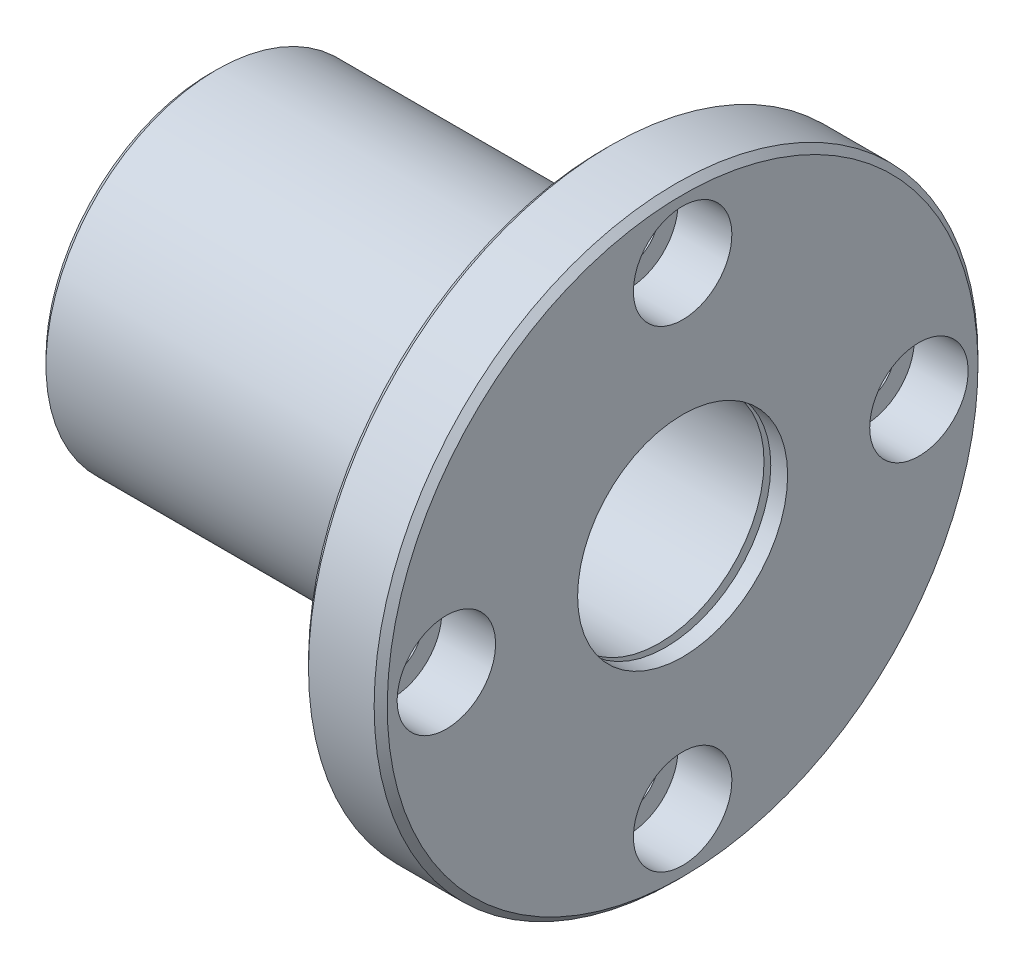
ISO-10303-21;
HEADER;
FILE_DESCRIPTION(('STEP AP214'),'2;1');
FILE_NAME('part.step','',(''),(''),'','','');
FILE_SCHEMA(('AUTOMOTIVE_DESIGN { 1 0 10303 214 1 1 1 1 }'));
ENDSEC;
DATA;
#1=APPLICATION_CONTEXT('core data for automotive mechanical design processes');
#2=APPLICATION_PROTOCOL_DEFINITION('international standard','automotive_design',2000,#1);
#3=PRODUCT_CONTEXT('',#1,'mechanical');
#4=PRODUCT('Part','Part','',(#3));
#5=PRODUCT_RELATED_PRODUCT_CATEGORY('part','',(#4));
#6=PRODUCT_DEFINITION_FORMATION('','',#4);
#7=PRODUCT_DEFINITION_CONTEXT('part definition',#1,'design');
#8=PRODUCT_DEFINITION('design','',#6,#7);
#9=PRODUCT_DEFINITION_SHAPE('','',#8);
#10=(LENGTH_UNIT() NAMED_UNIT(*) SI_UNIT(.MILLI.,.METRE.));
#11=(NAMED_UNIT(*) PLANE_ANGLE_UNIT() SI_UNIT($,.RADIAN.));
#12=(NAMED_UNIT(*) SI_UNIT($,.STERADIAN.) SOLID_ANGLE_UNIT());
#13=UNCERTAINTY_MEASURE_WITH_UNIT(LENGTH_MEASURE(1.E-05),#10,'distance_accuracy_value','');
#14=(GEOMETRIC_REPRESENTATION_CONTEXT(3) GLOBAL_UNCERTAINTY_ASSIGNED_CONTEXT((#13)) GLOBAL_UNIT_ASSIGNED_CONTEXT((#10,
#11,#12)) REPRESENTATION_CONTEXT('',''));
#15=CARTESIAN_POINT('',(0.,0.,0.));
#16=DIRECTION('',(0.,0.,1.));
#17=DIRECTION('',(1.,0.,0.));
#18=AXIS2_PLACEMENT_3D('',#15,#16,#17);
#19=CARTESIAN_POINT('',(0.,10.5,0.));
#20=DIRECTION('',(-1.,0.,0.));
#21=DIRECTION('',(0.,0.,1.));
#22=AXIS2_PLACEMENT_3D('',#19,#20,#21);
#23=PLANE('',#22);
#24=CARTESIAN_POINT('',(0.,0.,0.));
#25=DIRECTION('',(-1.,0.,0.));
#26=DIRECTION('',(0.,1.,0.));
#27=AXIS2_PLACEMENT_3D('',#24,#25,#26);
#28=CIRCLE('',#27,8.5);
#29=CARTESIAN_POINT('',(0.,-8.5,0.));
#30=VERTEX_POINT('',#29);
#31=EDGE_CURVE('E273',#30,#30,#28,.T.);
#32=ORIENTED_EDGE('',*,*,#31,.F.);
#33=EDGE_LOOP('',(#32));
#34=FACE_BOUND('',#33,.T.);
#35=CARTESIAN_POINT('',(0.,0.,0.));
#36=DIRECTION('',(-1.,0.,0.));
#37=DIRECTION('',(0.,1.,0.));
#38=AXIS2_PLACEMENT_3D('',#35,#36,#37);
#39=CIRCLE('',#38,12.5);
#40=CARTESIAN_POINT('',(0.,-12.5,0.));
#41=VERTEX_POINT('',#40);
#42=EDGE_CURVE('E248',#41,#41,#39,.T.);
#43=ORIENTED_EDGE('',*,*,#42,.T.);
#44=EDGE_LOOP('',(#43));
#45=FACE_BOUND('',#44,.T.);
#46=ADVANCED_FACE('F16',(#34,#45),#23,.T.);
#47=CARTESIAN_POINT('',(30.,17.9190437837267,0.));
#48=DIRECTION('',(-1.,0.,0.));
#49=DIRECTION('',(0.,0.,1.));
#50=AXIS2_PLACEMENT_3D('',#47,#48,#49);
#51=PLANE('',#50);
#52=CARTESIAN_POINT('',(30.,0.,0.));
#53=DIRECTION('',(-1.,0.,0.));
#54=DIRECTION('',(0.,1.,0.));
#55=AXIS2_PLACEMENT_3D('',#52,#53,#54);
#56=CIRCLE('',#55,13.3380875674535);
#57=CARTESIAN_POINT('',(30.,13.3380875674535,0.));
#58=VERTEX_POINT('',#57);
#59=CARTESIAN_POINT('',(30.,0.,-13.3380875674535));
#60=VERTEX_POINT('',#59);
#61=EDGE_CURVE('E222',#58,#60,#56,.T.);
#62=ORIENTED_EDGE('',*,*,#61,.F.);
#63=CARTESIAN_POINT('',(30.,0.,0.));
#64=DIRECTION('',(-1.,0.,0.));
#65=DIRECTION('',(0.,1.,0.));
#66=AXIS2_PLACEMENT_3D('',#63,#64,#65);
#67=CIRCLE('',#66,13.3380875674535);
#68=EDGE_CURVE('E218',#60,#58,#67,.T.);
#69=ORIENTED_EDGE('',*,*,#68,.F.);
#70=EDGE_LOOP('',(#62,#69));
#71=FACE_BOUND('',#70,.T.);
#72=CARTESIAN_POINT('',(30.,18.,0.));
#73=DIRECTION('',(1.,0.,0.));
#74=DIRECTION('',(0.,1.,0.));
#75=AXIS2_PLACEMENT_3D('',#72,#73,#74);
#76=CIRCLE('',#75,2.25);
#77=CARTESIAN_POINT('',(30.,15.75,0.));
#78=VERTEX_POINT('',#77);
#79=EDGE_CURVE('E297',#78,#78,#76,.T.);
#80=ORIENTED_EDGE('',*,*,#79,.T.);
#81=EDGE_LOOP('',(#80));
#82=FACE_BOUND('',#81,.T.);
#83=CARTESIAN_POINT('',(30.,-18.,0.));
#84=DIRECTION('',(1.,0.,0.));
#85=DIRECTION('',(0.,1.,0.));
#86=AXIS2_PLACEMENT_3D('',#83,#84,#85);
#87=CIRCLE('',#86,2.25);
#88=CARTESIAN_POINT('',(30.,-20.25,0.));
#89=VERTEX_POINT('',#88);
#90=EDGE_CURVE('E246',#89,#89,#87,.T.);
#91=ORIENTED_EDGE('',*,*,#90,.T.);
#92=EDGE_LOOP('',(#91));
#93=FACE_BOUND('',#92,.T.);
#94=CARTESIAN_POINT('',(30.,0.,18.));
#95=DIRECTION('',(1.,0.,0.));
#96=DIRECTION('',(0.,0.,-1.));
#97=AXIS2_PLACEMENT_3D('',#94,#95,#96);
#98=CIRCLE('',#97,2.25);
#99=CARTESIAN_POINT('',(30.,0.,20.25));
#100=VERTEX_POINT('',#99);
#101=EDGE_CURVE('E237',#100,#100,#98,.T.);
#102=ORIENTED_EDGE('',*,*,#101,.T.);
#103=EDGE_LOOP('',(#102));
#104=FACE_BOUND('',#103,.T.);
#105=CARTESIAN_POINT('',(30.,0.,-18.));
#106=DIRECTION('',(1.,0.,0.));
#107=DIRECTION('',(0.,0.,-1.));
#108=AXIS2_PLACEMENT_3D('',#105,#106,#107);
#109=CIRCLE('',#108,2.25);
#110=CARTESIAN_POINT('',(30.,0.,-15.75));
#111=VERTEX_POINT('',#110);
#112=EDGE_CURVE('E308',#111,#111,#109,.T.);
#113=ORIENTED_EDGE('',*,*,#112,.T.);
#114=EDGE_LOOP('',(#113));
#115=FACE_BOUND('',#114,.T.);
#116=CARTESIAN_POINT('',(30.,0.,0.));
#117=DIRECTION('',(-1.,0.,0.));
#118=DIRECTION('',(0.,1.,0.));
#119=AXIS2_PLACEMENT_3D('',#116,#117,#118);
#120=CIRCLE('',#119,22.5);
#121=CARTESIAN_POINT('',(30.,-22.5,0.));
#122=VERTEX_POINT('',#121);
#123=EDGE_CURVE('E262',#122,#122,#120,.T.);
#124=ORIENTED_EDGE('',*,*,#123,.T.);
#125=EDGE_LOOP('',(#124));
#126=FACE_BOUND('',#125,.T.);
#127=ADVANCED_FACE('F405',(#71,#82,#93,#104,#115,#126),#51,.T.);
#128=CARTESIAN_POINT('',(36.,15.25,0.));
#129=DIRECTION('',(1.,0.,0.));
#130=DIRECTION('',(0.,1.,0.));
#131=AXIS2_PLACEMENT_3D('',#128,#129,#130);
#132=PLANE('',#131);
#133=CARTESIAN_POINT('',(36.,18.,0.));
#134=DIRECTION('',(-1.,0.,0.));
#135=DIRECTION('',(0.,1.,0.));
#136=AXIS2_PLACEMENT_3D('',#133,#134,#135);
#137=CIRCLE('',#136,3.75);
#138=CARTESIAN_POINT('',(36.,14.25,0.));
#139=VERTEX_POINT('',#138);
#140=EDGE_CURVE('E243',#139,#139,#137,.T.);
#141=ORIENTED_EDGE('',*,*,#140,.T.);
#142=EDGE_LOOP('',(#141));
#143=FACE_BOUND('',#142,.T.);
#144=CARTESIAN_POINT('',(36.,-18.,0.));
#145=DIRECTION('',(-1.,0.,0.));
#146=DIRECTION('',(0.,1.,0.));
#147=AXIS2_PLACEMENT_3D('',#144,#145,#146);
#148=CIRCLE('',#147,3.75);
#149=CARTESIAN_POINT('',(36.,-21.75,0.));
#150=VERTEX_POINT('',#149);
#151=EDGE_CURVE('E242',#150,#150,#148,.T.);
#152=ORIENTED_EDGE('',*,*,#151,.T.);
#153=EDGE_LOOP('',(#152));
#154=FACE_BOUND('',#153,.T.);
#155=CARTESIAN_POINT('',(36.,0.,18.));
#156=DIRECTION('',(-1.,0.,0.));
#157=DIRECTION('',(0.,0.,-1.));
#158=AXIS2_PLACEMENT_3D('',#155,#156,#157);
#159=CIRCLE('',#158,3.75);
#160=CARTESIAN_POINT('',(36.,0.,21.75));
#161=VERTEX_POINT('',#160);
#162=EDGE_CURVE('E312',#161,#161,#159,.T.);
#163=ORIENTED_EDGE('',*,*,#162,.T.);
#164=EDGE_LOOP('',(#163));
#165=FACE_BOUND('',#164,.T.);
#166=CARTESIAN_POINT('',(36.,0.,-18.));
#167=DIRECTION('',(-1.,0.,0.));
#168=DIRECTION('',(0.,0.,-1.));
#169=AXIS2_PLACEMENT_3D('',#166,#167,#168);
#170=CIRCLE('',#169,3.75);
#171=CARTESIAN_POINT('',(36.,0.,-14.25));
#172=VERTEX_POINT('',#171);
#173=EDGE_CURVE('E10',#172,#172,#170,.T.);
#174=ORIENTED_EDGE('',*,*,#173,.T.);
#175=EDGE_LOOP('',(#174));
#176=FACE_BOUND('',#175,.T.);
#177=CARTESIAN_POINT('',(36.,0.,0.));
#178=DIRECTION('',(-1.,0.,0.));
#179=DIRECTION('',(0.,1.,0.));
#180=AXIS2_PLACEMENT_3D('',#177,#178,#179);
#181=CIRCLE('',#180,8.);
#182=CARTESIAN_POINT('',(36.,-8.,0.));
#183=VERTEX_POINT('',#182);
#184=EDGE_CURVE('E305',#183,#183,#181,.T.);
#185=ORIENTED_EDGE('',*,*,#184,.T.);
#186=EDGE_LOOP('',(#185));
#187=FACE_BOUND('',#186,.T.);
#188=CARTESIAN_POINT('',(36.,0.,0.));
#189=DIRECTION('',(-1.,0.,0.));
#190=DIRECTION('',(0.,1.,0.));
#191=AXIS2_PLACEMENT_3D('',#188,#189,#190);
#192=CIRCLE('',#191,22.5);
#193=CARTESIAN_POINT('',(36.,-22.5,0.));
#194=VERTEX_POINT('',#193);
#195=EDGE_CURVE('E282',#194,#194,#192,.T.);
#196=ORIENTED_EDGE('',*,*,#195,.F.);
#197=EDGE_LOOP('',(#196));
#198=FACE_BOUND('',#197,.T.);
#199=ADVANCED_FACE('F410',(#143,#154,#165,#176,#187,#198),#132,.T.);
#200=CARTESIAN_POINT('',(34.7142857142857,8.65,0.));
#201=DIRECTION('',(-1.,0.,0.));
#202=DIRECTION('',(0.,0.,1.));
#203=AXIS2_PLACEMENT_3D('',#200,#201,#202);
#204=PLANE('',#203);
#205=CARTESIAN_POINT('',(34.7142857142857,0.,0.));
#206=DIRECTION('',(-1.,0.,0.));
#207=DIRECTION('',(0.,1.,0.));
#208=AXIS2_PLACEMENT_3D('',#205,#206,#207);
#209=CIRCLE('',#208,8.);
#210=CARTESIAN_POINT('',(34.7142857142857,-8.,0.));
#211=VERTEX_POINT('',#210);
#212=EDGE_CURVE('E288',#211,#211,#209,.T.);
#213=ORIENTED_EDGE('',*,*,#212,.F.);
#214=EDGE_LOOP('',(#213));
#215=FACE_BOUND('',#214,.T.);
#216=CARTESIAN_POINT('',(34.7142857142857,0.,0.));
#217=DIRECTION('',(-1.,0.,0.));
#218=DIRECTION('',(0.,1.,0.));
#219=AXIS2_PLACEMENT_3D('',#216,#217,#218);
#220=CIRCLE('',#219,9.3);
#221=CARTESIAN_POINT('',(34.7142857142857,-9.3,0.));
#222=VERTEX_POINT('',#221);
#223=EDGE_CURVE('E216',#222,#222,#220,.T.);
#224=ORIENTED_EDGE('',*,*,#223,.T.);
#225=EDGE_LOOP('',(#224));
#226=FACE_BOUND('',#225,.T.);
#227=ADVANCED_FACE('F448',(#215,#226),#204,.T.);
#228=CARTESIAN_POINT('',(34.2,8.65,0.));
#229=DIRECTION('',(1.,0.,0.));
#230=DIRECTION('',(0.,1.,0.));
#231=AXIS2_PLACEMENT_3D('',#228,#229,#230);
#232=PLANE('',#231);
#233=CARTESIAN_POINT('',(34.2,0.,0.));
#234=DIRECTION('',(-1.,0.,0.));
#235=DIRECTION('',(0.,1.,0.));
#236=AXIS2_PLACEMENT_3D('',#233,#234,#235);
#237=CIRCLE('',#236,8.);
#238=CARTESIAN_POINT('',(34.2,-8.,0.));
#239=VERTEX_POINT('',#238);
#240=EDGE_CURVE('E319',#239,#239,#237,.T.);
#241=ORIENTED_EDGE('',*,*,#240,.T.);
#242=EDGE_LOOP('',(#241));
#243=FACE_BOUND('',#242,.T.);
#244=CARTESIAN_POINT('',(34.2,0.,0.));
#245=DIRECTION('',(-1.,0.,0.));
#246=DIRECTION('',(0.,1.,0.));
#247=AXIS2_PLACEMENT_3D('',#244,#245,#246);
#248=CIRCLE('',#247,9.3);
#249=CARTESIAN_POINT('',(34.2,-9.3,0.));
#250=VERTEX_POINT('',#249);
#251=EDGE_CURVE('E217',#250,#250,#248,.T.);
#252=ORIENTED_EDGE('',*,*,#251,.F.);
#253=EDGE_LOOP('',(#252));
#254=FACE_BOUND('',#253,.T.);
#255=ADVANCED_FACE('F454',(#243,#254),#232,.T.);
#256=CARTESIAN_POINT('',(1.8,8.65,0.));
#257=DIRECTION('',(-1.,0.,0.));
#258=DIRECTION('',(0.,0.,1.));
#259=AXIS2_PLACEMENT_3D('',#256,#257,#258);
#260=PLANE('',#259);
#261=CARTESIAN_POINT('',(1.8,0.,0.));
#262=DIRECTION('',(-1.,0.,0.));
#263=DIRECTION('',(0.,1.,0.));
#264=AXIS2_PLACEMENT_3D('',#261,#262,#263);
#265=CIRCLE('',#264,8.);
#266=CARTESIAN_POINT('',(1.8,-8.,0.));
#267=VERTEX_POINT('',#266);
#268=EDGE_CURVE('E318',#267,#267,#265,.T.);
#269=ORIENTED_EDGE('',*,*,#268,.F.);
#270=EDGE_LOOP('',(#269));
#271=FACE_BOUND('',#270,.T.);
#272=CARTESIAN_POINT('',(1.8,0.,0.));
#273=DIRECTION('',(-1.,0.,0.));
#274=DIRECTION('',(0.,1.,0.));
#275=AXIS2_PLACEMENT_3D('',#272,#273,#274);
#276=CIRCLE('',#275,9.3);
#277=CARTESIAN_POINT('',(1.8,-9.3,0.));
#278=VERTEX_POINT('',#277);
#279=EDGE_CURVE('E278',#278,#278,#276,.T.);
#280=ORIENTED_EDGE('',*,*,#279,.T.);
#281=EDGE_LOOP('',(#280));
#282=FACE_BOUND('',#281,.T.);
#283=ADVANCED_FACE('F458',(#271,#282),#260,.T.);
#284=CARTESIAN_POINT('',(1.28571428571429,8.9,0.));
#285=DIRECTION('',(1.,0.,0.));
#286=DIRECTION('',(0.,1.,0.));
#287=AXIS2_PLACEMENT_3D('',#284,#285,#286);
#288=PLANE('',#287);
#289=CARTESIAN_POINT('',(1.28571428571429,0.,0.));
#290=DIRECTION('',(-1.,0.,0.));
#291=DIRECTION('',(0.,1.,0.));
#292=AXIS2_PLACEMENT_3D('',#289,#290,#291);
#293=CIRCLE('',#292,8.5);
#294=CARTESIAN_POINT('',(1.28571428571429,-8.5,0.));
#295=VERTEX_POINT('',#294);
#296=EDGE_CURVE('E342',#295,#295,#293,.T.);
#297=ORIENTED_EDGE('',*,*,#296,.T.);
#298=EDGE_LOOP('',(#297));
#299=FACE_BOUND('',#298,.T.);
#300=CARTESIAN_POINT('',(1.28571428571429,0.,0.));
#301=DIRECTION('',(-1.,0.,0.));
#302=DIRECTION('',(0.,1.,0.));
#303=AXIS2_PLACEMENT_3D('',#300,#301,#302);
#304=CIRCLE('',#303,9.3);
#305=CARTESIAN_POINT('',(1.28571428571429,-9.3,0.));
#306=VERTEX_POINT('',#305);
#307=EDGE_CURVE('E322',#306,#306,#304,.T.);
#308=ORIENTED_EDGE('',*,*,#307,.F.);
#309=EDGE_LOOP('',(#308));
#310=FACE_BOUND('',#309,.T.);
#311=ADVANCED_FACE('F461',(#299,#310),#288,.T.);
#312=CARTESIAN_POINT('',(31.9,21.,0.));
#313=DIRECTION('',(-1.,0.,0.));
#314=DIRECTION('',(0.,0.,1.));
#315=AXIS2_PLACEMENT_3D('',#312,#313,#314);
#316=PLANE('',#315);
#317=CARTESIAN_POINT('',(31.9,18.,0.));
#318=DIRECTION('',(-1.,0.,0.));
#319=DIRECTION('',(0.,1.,0.));
#320=AXIS2_PLACEMENT_3D('',#317,#318,#319);
#321=CIRCLE('',#320,2.25);
#322=CARTESIAN_POINT('',(31.9,15.75,0.));
#323=VERTEX_POINT('',#322);
#324=EDGE_CURVE('E296',#323,#323,#321,.T.);
#325=ORIENTED_EDGE('',*,*,#324,.T.);
#326=EDGE_LOOP('',(#325));
#327=FACE_BOUND('',#326,.T.);
#328=CARTESIAN_POINT('',(31.9,18.,0.));
#329=DIRECTION('',(-1.,0.,0.));
#330=DIRECTION('',(0.,1.,0.));
#331=AXIS2_PLACEMENT_3D('',#328,#329,#330);
#332=CIRCLE('',#331,3.75);
#333=CARTESIAN_POINT('',(31.9,14.25,0.));
#334=VERTEX_POINT('',#333);
#335=EDGE_CURVE('E348',#334,#334,#332,.T.);
#336=ORIENTED_EDGE('',*,*,#335,.F.);
#337=EDGE_LOOP('',(#336));
#338=FACE_BOUND('',#337,.T.);
#339=ADVANCED_FACE('F463',(#327,#338),#316,.F.);
#340=CARTESIAN_POINT('',(31.9,-15.,0.));
#341=DIRECTION('',(-1.,0.,0.));
#342=DIRECTION('',(0.,0.,1.));
#343=AXIS2_PLACEMENT_3D('',#340,#341,#342);
#344=PLANE('',#343);
#345=CARTESIAN_POINT('',(31.9,-18.,0.));
#346=DIRECTION('',(-1.,0.,0.));
#347=DIRECTION('',(0.,1.,0.));
#348=AXIS2_PLACEMENT_3D('',#345,#346,#347);
#349=CIRCLE('',#348,2.25);
#350=CARTESIAN_POINT('',(31.9,-20.25,0.));
#351=VERTEX_POINT('',#350);
#352=EDGE_CURVE('E364',#351,#351,#349,.T.);
#353=ORIENTED_EDGE('',*,*,#352,.T.);
#354=EDGE_LOOP('',(#353));
#355=FACE_BOUND('',#354,.T.);
#356=CARTESIAN_POINT('',(31.9,-18.,0.));
#357=DIRECTION('',(-1.,0.,0.));
#358=DIRECTION('',(0.,1.,0.));
#359=AXIS2_PLACEMENT_3D('',#356,#357,#358);
#360=CIRCLE('',#359,3.75);
#361=CARTESIAN_POINT('',(31.9,-21.75,0.));
#362=VERTEX_POINT('',#361);
#363=EDGE_CURVE('E367',#362,#362,#360,.T.);
#364=ORIENTED_EDGE('',*,*,#363,.F.);
#365=EDGE_LOOP('',(#364));
#366=FACE_BOUND('',#365,.T.);
#367=ADVANCED_FACE('F400',(#355,#366),#344,.F.);
#368=CARTESIAN_POINT('',(31.9,0.,15.));
#369=DIRECTION('',(-1.,0.,0.));
#370=DIRECTION('',(0.,0.,1.));
#371=AXIS2_PLACEMENT_3D('',#368,#369,#370);
#372=PLANE('',#371);
#373=CARTESIAN_POINT('',(31.9,0.,18.));
#374=DIRECTION('',(-1.,0.,0.));
#375=DIRECTION('',(0.,0.,-1.));
#376=AXIS2_PLACEMENT_3D('',#373,#374,#375);
#377=CIRCLE('',#376,2.25);
#378=CARTESIAN_POINT('',(31.9,0.,20.25));
#379=VERTEX_POINT('',#378);
#380=EDGE_CURVE('E283',#379,#379,#377,.T.);
#381=ORIENTED_EDGE('',*,*,#380,.T.);
#382=EDGE_LOOP('',(#381));
#383=FACE_BOUND('',#382,.T.);
#384=CARTESIAN_POINT('',(31.9,0.,18.));
#385=DIRECTION('',(-1.,0.,0.));
#386=DIRECTION('',(0.,0.,-1.));
#387=AXIS2_PLACEMENT_3D('',#384,#385,#386);
#388=CIRCLE('',#387,3.75);
#389=CARTESIAN_POINT('',(31.9,0.,21.75));
#390=VERTEX_POINT('',#389);
#391=EDGE_CURVE('E210',#390,#390,#388,.T.);
#392=ORIENTED_EDGE('',*,*,#391,.F.);
#393=EDGE_LOOP('',(#392));
#394=FACE_BOUND('',#393,.T.);
#395=ADVANCED_FACE('F390',(#383,#394),#372,.F.);
#396=CARTESIAN_POINT('',(31.9,0.,-21.));
#397=DIRECTION('',(-1.,0.,0.));
#398=DIRECTION('',(0.,0.,1.));
#399=AXIS2_PLACEMENT_3D('',#396,#397,#398);
#400=PLANE('',#399);
#401=CARTESIAN_POINT('',(31.9,0.,-18.));
#402=DIRECTION('',(-1.,0.,0.));
#403=DIRECTION('',(0.,0.,-1.));
#404=AXIS2_PLACEMENT_3D('',#401,#402,#403);
#405=CIRCLE('',#404,2.25);
#406=CARTESIAN_POINT('',(31.9,0.,-15.75));
#407=VERTEX_POINT('',#406);
#408=EDGE_CURVE('E253',#407,#407,#405,.T.);
#409=ORIENTED_EDGE('',*,*,#408,.T.);
#410=EDGE_LOOP('',(#409));
#411=FACE_BOUND('',#410,.T.);
#412=CARTESIAN_POINT('',(31.9,0.,-18.));
#413=DIRECTION('',(-1.,0.,0.));
#414=DIRECTION('',(0.,0.,-1.));
#415=AXIS2_PLACEMENT_3D('',#412,#413,#414);
#416=CIRCLE('',#415,3.75);
#417=CARTESIAN_POINT('',(31.9,0.,-14.25));
#418=VERTEX_POINT('',#417);
#419=EDGE_CURVE('E256',#418,#418,#416,.T.);
#420=ORIENTED_EDGE('',*,*,#419,.F.);
#421=EDGE_LOOP('',(#420));
#422=FACE_BOUND('',#421,.T.);
#423=ADVANCED_FACE('F388',(#411,#422),#400,.F.);
#424=CARTESIAN_POINT('',(33.95,0.,-18.));
#425=DIRECTION('',(1.,0.,0.));
#426=DIRECTION('',(0.,0.,-1.));
#427=AXIS2_PLACEMENT_3D('',#424,#425,#426);
#428=CYLINDRICAL_SURFACE('',#427,3.75);
#429=ORIENTED_EDGE('',*,*,#419,.T.);
#430=DIRECTION('',(1.,0.,0.));
#431=VECTOR('',#430,1.);
#432=CARTESIAN_POINT('',(33.95,0.,-14.25));
#433=LINE('',#432,#431);
#434=EDGE_CURVE('E24',#418,#172,#433,.T.);
#435=ORIENTED_EDGE('',*,*,#434,.T.);
#436=ORIENTED_EDGE('',*,*,#173,.F.);
#437=ORIENTED_EDGE('',*,*,#434,.F.);
#438=EDGE_LOOP('',(#429,#435,#436,#437));
#439=FACE_BOUND('',#438,.T.);
#440=ADVANCED_FACE('F386',(#439),#428,.F.);
#441=CARTESIAN_POINT('',(30.95,0.,-18.));
#442=DIRECTION('',(1.,0.,0.));
#443=DIRECTION('',(0.,0.,-1.));
#444=AXIS2_PLACEMENT_3D('',#441,#442,#443);
#445=CYLINDRICAL_SURFACE('',#444,2.25);
#446=ORIENTED_EDGE('',*,*,#112,.F.);
#447=DIRECTION('',(1.,0.,0.));
#448=VECTOR('',#447,1.);
#449=CARTESIAN_POINT('',(30.95,0.,-15.75));
#450=LINE('',#449,#448);
#451=EDGE_CURVE('E257',#111,#407,#450,.T.);
#452=ORIENTED_EDGE('',*,*,#451,.T.);
#453=ORIENTED_EDGE('',*,*,#408,.F.);
#454=ORIENTED_EDGE('',*,*,#451,.F.);
#455=EDGE_LOOP('',(#446,#452,#453,#454));
#456=FACE_BOUND('',#455,.T.);
#457=ADVANCED_FACE('F398',(#456),#445,.F.);
#458=CARTESIAN_POINT('',(33.95,0.,18.));
#459=DIRECTION('',(1.,0.,0.));
#460=DIRECTION('',(0.,0.,-1.));
#461=AXIS2_PLACEMENT_3D('',#458,#459,#460);
#462=CYLINDRICAL_SURFACE('',#461,3.75);
#463=ORIENTED_EDGE('',*,*,#391,.T.);
#464=DIRECTION('',(1.,0.,0.));
#465=VECTOR('',#464,1.);
#466=CARTESIAN_POINT('',(33.95,0.,21.75));
#467=LINE('',#466,#465);
#468=EDGE_CURVE('E377',#390,#161,#467,.T.);
#469=ORIENTED_EDGE('',*,*,#468,.T.);
#470=ORIENTED_EDGE('',*,*,#162,.F.);
#471=ORIENTED_EDGE('',*,*,#468,.F.);
#472=EDGE_LOOP('',(#463,#469,#470,#471));
#473=FACE_BOUND('',#472,.T.);
#474=ADVANCED_FACE('F525',(#473),#462,.F.);
#475=CARTESIAN_POINT('',(30.95,0.,18.));
#476=DIRECTION('',(1.,0.,0.));
#477=DIRECTION('',(0.,0.,-1.));
#478=AXIS2_PLACEMENT_3D('',#475,#476,#477);
#479=CYLINDRICAL_SURFACE('',#478,2.25);
#480=ORIENTED_EDGE('',*,*,#101,.F.);
#481=DIRECTION('',(1.,0.,0.));
#482=VECTOR('',#481,1.);
#483=CARTESIAN_POINT('',(30.95,0.,20.25));
#484=LINE('',#483,#482);
#485=EDGE_CURVE('E241',#100,#379,#484,.T.);
#486=ORIENTED_EDGE('',*,*,#485,.T.);
#487=ORIENTED_EDGE('',*,*,#380,.F.);
#488=ORIENTED_EDGE('',*,*,#485,.F.);
#489=EDGE_LOOP('',(#480,#486,#487,#488));
#490=FACE_BOUND('',#489,.T.);
#491=ADVANCED_FACE('F522',(#490),#479,.F.);
#492=CARTESIAN_POINT('',(33.95,-18.,0.));
#493=DIRECTION('',(1.,0.,0.));
#494=DIRECTION('',(0.,1.,0.));
#495=AXIS2_PLACEMENT_3D('',#492,#493,#494);
#496=CYLINDRICAL_SURFACE('',#495,3.75);
#497=ORIENTED_EDGE('',*,*,#363,.T.);
#498=DIRECTION('',(1.,0.,0.));
#499=VECTOR('',#498,1.);
#500=CARTESIAN_POINT('',(33.95,-21.75,0.));
#501=LINE('',#500,#499);
#502=EDGE_CURVE('E291',#362,#150,#501,.T.);
#503=ORIENTED_EDGE('',*,*,#502,.T.);
#504=ORIENTED_EDGE('',*,*,#151,.F.);
#505=ORIENTED_EDGE('',*,*,#502,.F.);
#506=EDGE_LOOP('',(#497,#503,#504,#505));
#507=FACE_BOUND('',#506,.T.);
#508=ADVANCED_FACE('F475',(#507),#496,.F.);
#509=CARTESIAN_POINT('',(30.95,-18.,0.));
#510=DIRECTION('',(1.,0.,0.));
#511=DIRECTION('',(0.,1.,0.));
#512=AXIS2_PLACEMENT_3D('',#509,#510,#511);
#513=CYLINDRICAL_SURFACE('',#512,2.25);
#514=ORIENTED_EDGE('',*,*,#90,.F.);
#515=DIRECTION('',(1.,0.,0.));
#516=VECTOR('',#515,1.);
#517=CARTESIAN_POINT('',(30.95,-20.25,0.));
#518=LINE('',#517,#516);
#519=EDGE_CURVE('E360',#89,#351,#518,.T.);
#520=ORIENTED_EDGE('',*,*,#519,.T.);
#521=ORIENTED_EDGE('',*,*,#352,.F.);
#522=ORIENTED_EDGE('',*,*,#519,.F.);
#523=EDGE_LOOP('',(#514,#520,#521,#522));
#524=FACE_BOUND('',#523,.T.);
#525=ADVANCED_FACE('F511',(#524),#513,.F.);
#526=CARTESIAN_POINT('',(33.95,18.,0.));
#527=DIRECTION('',(1.,0.,0.));
#528=DIRECTION('',(0.,1.,0.));
#529=AXIS2_PLACEMENT_3D('',#526,#527,#528);
#530=CYLINDRICAL_SURFACE('',#529,3.75);
#531=ORIENTED_EDGE('',*,*,#335,.T.);
#532=DIRECTION('',(1.,0.,0.));
#533=VECTOR('',#532,1.);
#534=CARTESIAN_POINT('',(33.95,14.25,0.));
#535=LINE('',#534,#533);
#536=EDGE_CURVE('E247',#334,#139,#535,.T.);
#537=ORIENTED_EDGE('',*,*,#536,.T.);
#538=ORIENTED_EDGE('',*,*,#140,.F.);
#539=ORIENTED_EDGE('',*,*,#536,.F.);
#540=EDGE_LOOP('',(#531,#537,#538,#539));
#541=FACE_BOUND('',#540,.T.);
#542=ADVANCED_FACE('F507',(#541),#530,.F.);
#543=CARTESIAN_POINT('',(30.95,18.,0.));
#544=DIRECTION('',(1.,0.,0.));
#545=DIRECTION('',(0.,1.,0.));
#546=AXIS2_PLACEMENT_3D('',#543,#544,#545);
#547=CYLINDRICAL_SURFACE('',#546,2.25);
#548=ORIENTED_EDGE('',*,*,#79,.F.);
#549=DIRECTION('',(1.,0.,0.));
#550=VECTOR('',#549,1.);
#551=CARTESIAN_POINT('',(30.95,15.75,0.));
#552=LINE('',#551,#550);
#553=EDGE_CURVE('E292',#78,#323,#552,.T.);
#554=ORIENTED_EDGE('',*,*,#553,.T.);
#555=ORIENTED_EDGE('',*,*,#324,.F.);
#556=ORIENTED_EDGE('',*,*,#553,.F.);
#557=EDGE_LOOP('',(#548,#554,#555,#556));
#558=FACE_BOUND('',#557,.T.);
#559=ADVANCED_FACE('F510',(#558),#547,.F.);
#560=CARTESIAN_POINT('',(0.642857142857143,0.,0.));
#561=DIRECTION('',(1.,0.,0.));
#562=DIRECTION('',(0.,1.,0.));
#563=AXIS2_PLACEMENT_3D('',#560,#561,#562);
#564=CYLINDRICAL_SURFACE('',#563,8.5);
#565=ORIENTED_EDGE('',*,*,#31,.T.);
#566=DIRECTION('',(1.,0.,0.));
#567=VECTOR('',#566,1.);
#568=CARTESIAN_POINT('',(0.642857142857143,-8.5,0.));
#569=LINE('',#568,#567);
#570=EDGE_CURVE('E277',#30,#295,#569,.T.);
#571=ORIENTED_EDGE('',*,*,#570,.T.);
#572=ORIENTED_EDGE('',*,*,#296,.F.);
#573=ORIENTED_EDGE('',*,*,#570,.F.);
#574=EDGE_LOOP('',(#565,#571,#572,#573));
#575=FACE_BOUND('',#574,.T.);
#576=ADVANCED_FACE('F515',(#575),#564,.F.);
#577=CARTESIAN_POINT('',(1.54285714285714,0.,0.));
#578=DIRECTION('',(1.,0.,0.));
#579=DIRECTION('',(0.,1.,0.));
#580=AXIS2_PLACEMENT_3D('',#577,#578,#579);
#581=CYLINDRICAL_SURFACE('',#580,9.3);
#582=ORIENTED_EDGE('',*,*,#307,.T.);
#583=DIRECTION('',(1.,0.,0.));
#584=VECTOR('',#583,1.);
#585=CARTESIAN_POINT('',(1.54285714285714,-9.3,0.));
#586=LINE('',#585,#584);
#587=EDGE_CURVE('E333',#306,#278,#586,.T.);
#588=ORIENTED_EDGE('',*,*,#587,.T.);
#589=ORIENTED_EDGE('',*,*,#279,.F.);
#590=ORIENTED_EDGE('',*,*,#587,.F.);
#591=EDGE_LOOP('',(#582,#588,#589,#590));
#592=FACE_BOUND('',#591,.T.);
#593=ADVANCED_FACE('F505',(#592),#581,.F.);
#594=CARTESIAN_POINT('',(18.,0.,0.));
#595=DIRECTION('',(1.,0.,0.));
#596=DIRECTION('',(0.,1.,0.));
#597=AXIS2_PLACEMENT_3D('',#594,#595,#596);
#598=CYLINDRICAL_SURFACE('',#597,8.);
#599=ORIENTED_EDGE('',*,*,#268,.T.);
#600=DIRECTION('',(1.,0.,0.));
#601=VECTOR('',#600,1.);
#602=CARTESIAN_POINT('',(18.,-8.,0.));
#603=LINE('',#602,#601);
#604=EDGE_CURVE('E323',#267,#239,#603,.T.);
#605=ORIENTED_EDGE('',*,*,#604,.T.);
#606=ORIENTED_EDGE('',*,*,#240,.F.);
#607=ORIENTED_EDGE('',*,*,#604,.F.);
#608=EDGE_LOOP('',(#599,#605,#606,#607));
#609=FACE_BOUND('',#608,.T.);
#610=ADVANCED_FACE('F502',(#609),#598,.F.);
#611=CARTESIAN_POINT('',(34.4571428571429,0.,0.));
#612=DIRECTION('',(1.,0.,0.));
#613=DIRECTION('',(0.,1.,0.));
#614=AXIS2_PLACEMENT_3D('',#611,#612,#613);
#615=CYLINDRICAL_SURFACE('',#614,9.3);
#616=ORIENTED_EDGE('',*,*,#251,.T.);
#617=DIRECTION('',(1.,0.,0.));
#618=VECTOR('',#617,1.);
#619=CARTESIAN_POINT('',(34.4571428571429,-9.3,0.));
#620=LINE('',#619,#618);
#621=EDGE_CURVE('E212',#250,#222,#620,.T.);
#622=ORIENTED_EDGE('',*,*,#621,.T.);
#623=ORIENTED_EDGE('',*,*,#223,.F.);
#624=ORIENTED_EDGE('',*,*,#621,.F.);
#625=EDGE_LOOP('',(#616,#622,#623,#624));
#626=FACE_BOUND('',#625,.T.);
#627=ADVANCED_FACE('F487',(#626),#615,.F.);
#628=CARTESIAN_POINT('',(35.3571428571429,0.,0.));
#629=DIRECTION('',(1.,0.,0.));
#630=DIRECTION('',(0.,1.,0.));
#631=AXIS2_PLACEMENT_3D('',#628,#629,#630);
#632=CYLINDRICAL_SURFACE('',#631,8.);
#633=ORIENTED_EDGE('',*,*,#212,.T.);
#634=DIRECTION('',(1.,0.,0.));
#635=VECTOR('',#634,1.);
#636=CARTESIAN_POINT('',(35.3571428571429,-8.,0.));
#637=LINE('',#636,#635);
#638=EDGE_CURVE('E301',#211,#183,#637,.T.);
#639=ORIENTED_EDGE('',*,*,#638,.T.);
#640=ORIENTED_EDGE('',*,*,#184,.F.);
#641=ORIENTED_EDGE('',*,*,#638,.F.);
#642=EDGE_LOOP('',(#633,#639,#640,#641));
#643=FACE_BOUND('',#642,.T.);
#644=ADVANCED_FACE('F482',(#643),#632,.F.);
#645=CARTESIAN_POINT('',(35.75,0.,0.));
#646=DIRECTION('',(-1.,0.,0.));
#647=DIRECTION('',(0.,1.,0.));
#648=AXIS2_PLACEMENT_3D('',#645,#646,#647);
#649=CONICAL_SURFACE('',#648,22.75,0.785398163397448);
#650=CARTESIAN_POINT('',(35.5,0.,0.));
#651=DIRECTION('',(-1.,0.,0.));
#652=DIRECTION('',(0.,1.,0.));
#653=AXIS2_PLACEMENT_3D('',#650,#651,#652);
#654=CIRCLE('',#653,23.);
#655=CARTESIAN_POINT('',(35.5,-23.,0.));
#656=VERTEX_POINT('',#655);
#657=EDGE_CURVE('E236',#656,#656,#654,.T.);
#658=ORIENTED_EDGE('',*,*,#657,.F.);
#659=DIRECTION('',(0.707106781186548,0.707106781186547,0.));
#660=VECTOR('',#659,1.);
#661=CARTESIAN_POINT('',(35.75,-22.75,0.));
#662=LINE('',#661,#660);
#663=EDGE_CURVE('E235',#656,#194,#662,.T.);
#664=ORIENTED_EDGE('',*,*,#663,.T.);
#665=ORIENTED_EDGE('',*,*,#195,.T.);
#666=ORIENTED_EDGE('',*,*,#663,.F.);
#667=EDGE_LOOP('',(#658,#664,#665,#666));
#668=FACE_BOUND('',#667,.T.);
#669=ADVANCED_FACE('F444',(#668),#649,.T.);
#670=CARTESIAN_POINT('',(33.,0.,0.));
#671=DIRECTION('',(1.,0.,0.));
#672=DIRECTION('',(0.,1.,0.));
#673=AXIS2_PLACEMENT_3D('',#670,#671,#672);
#674=CYLINDRICAL_SURFACE('',#673,23.);
#675=ORIENTED_EDGE('',*,*,#657,.T.);
#676=DIRECTION('',(-1.,0.,0.));
#677=VECTOR('',#676,1.);
#678=CARTESIAN_POINT('',(33.,-23.,0.));
#679=LINE('',#678,#677);
#680=CARTESIAN_POINT('',(30.5,-23.,0.));
#681=VERTEX_POINT('',#680);
#682=EDGE_CURVE('E232',#656,#681,#679,.T.);
#683=ORIENTED_EDGE('',*,*,#682,.T.);
#684=CARTESIAN_POINT('',(30.5,0.,0.));
#685=DIRECTION('',(-1.,0.,0.));
#686=DIRECTION('',(0.,1.,0.));
#687=AXIS2_PLACEMENT_3D('',#684,#685,#686);
#688=CIRCLE('',#687,23.);
#689=EDGE_CURVE('E192',#681,#681,#688,.T.);
#690=ORIENTED_EDGE('',*,*,#689,.F.);
#691=ORIENTED_EDGE('',*,*,#682,.F.);
#692=EDGE_LOOP('',(#675,#683,#690,#691));
#693=FACE_BOUND('',#692,.T.);
#694=ADVANCED_FACE('F441',(#693),#674,.T.);
#695=CARTESIAN_POINT('',(30.25,0.,0.));
#696=DIRECTION('',(1.,0.,0.));
#697=DIRECTION('',(0.,1.,0.));
#698=AXIS2_PLACEMENT_3D('',#695,#696,#697);
#699=CONICAL_SURFACE('',#698,22.75,0.785398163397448);
#700=ORIENTED_EDGE('',*,*,#689,.T.);
#701=DIRECTION('',(-0.707106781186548,0.707106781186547,0.));
#702=VECTOR('',#701,1.);
#703=CARTESIAN_POINT('',(30.25,-22.75,0.));
#704=LINE('',#703,#702);
#705=EDGE_CURVE('E267',#681,#122,#704,.T.);
#706=ORIENTED_EDGE('',*,*,#705,.T.);
#707=ORIENTED_EDGE('',*,*,#123,.F.);
#708=ORIENTED_EDGE('',*,*,#705,.F.);
#709=EDGE_LOOP('',(#700,#706,#707,#708));
#710=FACE_BOUND('',#709,.T.);
#711=ADVANCED_FACE('F437',(#710),#699,.T.);
#712=CARTESIAN_POINT('',(28.7323445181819,0.,0.));
#713=DIRECTION('',(-1.,0.,0.));
#714=DIRECTION('',(0.,1.,0.));
#715=AXIS2_PLACEMENT_3D('',#712,#713,#714);
#716=CONICAL_SURFACE('',#715,12.8767721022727,0.227474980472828);
#717=CARTESIAN_POINT('',(28.2,0.,0.));
#718=DIRECTION('',(-1.,0.,0.));
#719=DIRECTION('',(0.,1.,0.));
#720=AXIS2_PLACEMENT_3D('',#717,#718,#719);
#721=CIRCLE('',#720,13.);
#722=CARTESIAN_POINT('',(28.2,-13.,0.));
#723=VERTEX_POINT('',#722);
#724=EDGE_CURVE('E189',#723,#723,#721,.T.);
#725=ORIENTED_EDGE('',*,*,#724,.F.);
#726=DIRECTION('',(0.974238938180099,0.225518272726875,0.));
#727=VECTOR('',#726,1.);
#728=CARTESIAN_POINT('',(28.7323445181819,-12.8767721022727,0.));
#729=LINE('',#728,#727);
#730=CARTESIAN_POINT('',(29.2646890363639,-12.7535442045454,0.));
#731=VERTEX_POINT('',#730);
#732=EDGE_CURVE('E183',#723,#731,#729,.T.);
#733=ORIENTED_EDGE('',*,*,#732,.T.);
#734=CARTESIAN_POINT('',(29.2646890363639,0.,0.));
#735=DIRECTION('',(-1.,0.,0.));
#736=DIRECTION('',(0.,1.,0.));
#737=AXIS2_PLACEMENT_3D('',#734,#735,#736);
#738=CIRCLE('',#737,12.7535442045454);
#739=CARTESIAN_POINT('',(29.2646890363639,0.,-12.7535442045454));
#740=VERTEX_POINT('',#739);
#741=EDGE_CURVE('E187',#731,#740,#738,.T.);
#742=ORIENTED_EDGE('',*,*,#741,.T.);
#743=CARTESIAN_POINT('',(29.2646890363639,0.,0.));
#744=DIRECTION('',(-1.,0.,0.));
#745=DIRECTION('',(0.,1.,0.));
#746=AXIS2_PLACEMENT_3D('',#743,#744,#745);
#747=CIRCLE('',#746,12.7535442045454);
#748=EDGE_CURVE('E196',#740,#731,#747,.T.);
#749=ORIENTED_EDGE('',*,*,#748,.T.);
#750=ORIENTED_EDGE('',*,*,#732,.F.);
#751=EDGE_LOOP('',(#725,#733,#742,#749,#750));
#752=FACE_BOUND('',#751,.T.);
#753=ADVANCED_FACE('F185',(#752),#716,.T.);
#754=CARTESIAN_POINT('',(14.35,0.,0.));
#755=DIRECTION('',(1.,0.,0.));
#756=DIRECTION('',(0.,1.,0.));
#757=AXIS2_PLACEMENT_3D('',#754,#755,#756);
#758=CYLINDRICAL_SURFACE('',#757,13.);
#759=ORIENTED_EDGE('',*,*,#724,.T.);
#760=DIRECTION('',(-1.,0.,0.));
#761=VECTOR('',#760,1.);
#762=CARTESIAN_POINT('',(14.35,-13.,0.));
#763=LINE('',#762,#761);
#764=CARTESIAN_POINT('',(0.5,-13.,0.));
#765=VERTEX_POINT('',#764);
#766=EDGE_CURVE('E193',#723,#765,#763,.T.);
#767=ORIENTED_EDGE('',*,*,#766,.T.);
#768=CARTESIAN_POINT('',(0.5,0.,0.));
#769=DIRECTION('',(-1.,0.,0.));
#770=DIRECTION('',(0.,1.,0.));
#771=AXIS2_PLACEMENT_3D('',#768,#769,#770);
#772=CIRCLE('',#771,13.);
#773=EDGE_CURVE('E227',#765,#765,#772,.T.);
#774=ORIENTED_EDGE('',*,*,#773,.F.);
#775=ORIENTED_EDGE('',*,*,#766,.F.);
#776=EDGE_LOOP('',(#759,#767,#774,#775));
#777=FACE_BOUND('',#776,.T.);
#778=ADVANCED_FACE('F610',(#777),#758,.T.);
#779=CARTESIAN_POINT('',(0.25,0.,0.));
#780=DIRECTION('',(1.,0.,0.));
#781=DIRECTION('',(0.,1.,0.));
#782=AXIS2_PLACEMENT_3D('',#779,#780,#781);
#783=CONICAL_SURFACE('',#782,12.75,0.785398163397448);
#784=ORIENTED_EDGE('',*,*,#773,.T.);
#785=DIRECTION('',(-0.707106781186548,0.707106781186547,0.));
#786=VECTOR('',#785,1.);
#787=CARTESIAN_POINT('',(0.25,-12.75,0.));
#788=LINE('',#787,#786);
#789=EDGE_CURVE('E231',#765,#41,#788,.T.);
#790=ORIENTED_EDGE('',*,*,#789,.T.);
#791=ORIENTED_EDGE('',*,*,#42,.F.);
#792=ORIENTED_EDGE('',*,*,#789,.F.);
#793=EDGE_LOOP('',(#784,#790,#791,#792));
#794=FACE_BOUND('',#793,.T.);
#795=ADVANCED_FACE('F418',(#794),#783,.T.);
#796=CARTESIAN_POINT('',(29.4,0.,0.));
#797=DIRECTION('',(-1.,0.,0.));
#798=DIRECTION('',(0.,0.,1.));
#799=AXIS2_PLACEMENT_3D('',#796,#797,#798);
#800=TOROIDAL_SURFACE('',#799,13.3380875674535,0.6);
#801=ORIENTED_EDGE('',*,*,#741,.F.);
#802=ORIENTED_EDGE('',*,*,#748,.F.);
#803=CARTESIAN_POINT('',(29.4,0.,-13.3380875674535));
#804=DIRECTION('',(0.,1.,0.));
#805=DIRECTION('',(0.,0.,-1.));
#806=AXIS2_PLACEMENT_3D('',#803,#804,#805);
#807=CIRCLE('',#806,0.6);
#808=EDGE_CURVE('E200',#740,#60,#807,.T.);
#809=ORIENTED_EDGE('',*,*,#808,.T.);
#810=ORIENTED_EDGE('',*,*,#68,.T.);
#811=ORIENTED_EDGE('',*,*,#61,.T.);
#812=ORIENTED_EDGE('',*,*,#808,.F.);
#813=EDGE_LOOP('',(#801,#802,#809,#810,#811,#812));
#814=FACE_BOUND('',#813,.T.);
#815=ADVANCED_FACE('F202',(#814),#800,.F.);
#816=CLOSED_SHELL('',(#46,#127,#199,#227,#255,#283,#311,#339,#367,#395,#423,#440,#457,#474,#491,
#508,#525,#542,#559,#576,#593,#610,#627,#644,#669,#694,#711,#753,#778,#795,#815));
#817=MANIFOLD_SOLID_BREP('B1',#816);
#818=ADVANCED_BREP_SHAPE_REPRESENTATION('',(#18,#817),#14);
#819=SHAPE_DEFINITION_REPRESENTATION(#9,#818);
ENDSEC;
END-ISO-10303-21;
